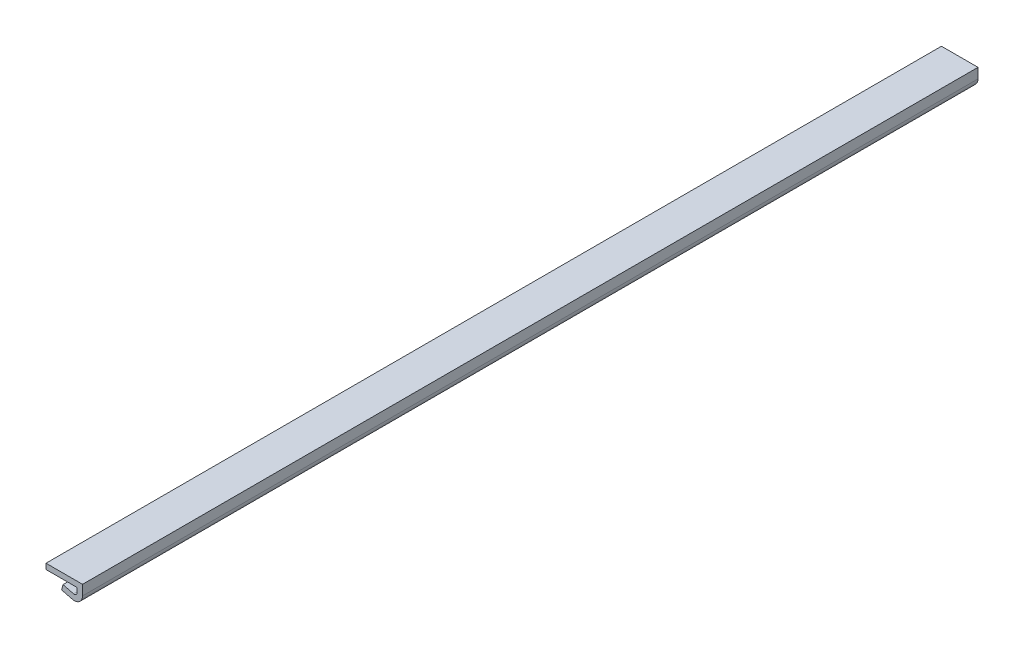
ISO-10303-21;
HEADER;
FILE_DESCRIPTION(('STEP AP214'),'2;1');
FILE_NAME('part.step','',(''),(''),'','','');
FILE_SCHEMA(('AUTOMOTIVE_DESIGN { 1 0 10303 214 1 1 1 1 }'));
ENDSEC;
DATA;
#1=APPLICATION_CONTEXT('core data for automotive mechanical design processes');
#2=APPLICATION_PROTOCOL_DEFINITION('international standard','automotive_design',2000,#1);
#3=PRODUCT_CONTEXT('',#1,'mechanical');
#4=PRODUCT('Part','Part','',(#3));
#5=PRODUCT_RELATED_PRODUCT_CATEGORY('part','',(#4));
#6=PRODUCT_DEFINITION_FORMATION('','',#4);
#7=PRODUCT_DEFINITION_CONTEXT('part definition',#1,'design');
#8=PRODUCT_DEFINITION('design','',#6,#7);
#9=PRODUCT_DEFINITION_SHAPE('','',#8);
#10=(LENGTH_UNIT() NAMED_UNIT(*) SI_UNIT(.MILLI.,.METRE.));
#11=(NAMED_UNIT(*) PLANE_ANGLE_UNIT() SI_UNIT($,.RADIAN.));
#12=(NAMED_UNIT(*) SI_UNIT($,.STERADIAN.) SOLID_ANGLE_UNIT());
#13=UNCERTAINTY_MEASURE_WITH_UNIT(LENGTH_MEASURE(1.E-05),#10,'distance_accuracy_value','');
#14=(GEOMETRIC_REPRESENTATION_CONTEXT(3) GLOBAL_UNCERTAINTY_ASSIGNED_CONTEXT((#13)) GLOBAL_UNIT_ASSIGNED_CONTEXT((#10,
#11,#12)) REPRESENTATION_CONTEXT('',''));
#15=CARTESIAN_POINT('',(0.,0.,0.));
#16=DIRECTION('',(0.,0.,1.));
#17=DIRECTION('',(1.,0.,0.));
#18=AXIS2_PLACEMENT_3D('',#15,#16,#17);
#19=CARTESIAN_POINT('',(0.,-1.66533453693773E-13,490.));
#20=DIRECTION('',(1.,0.,0.));
#21=DIRECTION('',(0.,1.,0.));
#22=AXIS2_PLACEMENT_3D('',#19,#20,#21);
#23=PLANE('',#22);
#24=DIRECTION('',(0.,-1.,0.));
#25=VECTOR('',#24,1.);
#26=CARTESIAN_POINT('',(0.,0.,0.));
#27=LINE('',#26,#25);
#28=CARTESIAN_POINT('',(0.,0.,0.));
#29=VERTEX_POINT('',#28);
#30=CARTESIAN_POINT('',(0.,-3.,0.));
#31=VERTEX_POINT('',#30);
#32=EDGE_CURVE('E119',#29,#31,#27,.T.);
#33=ORIENTED_EDGE('',*,*,#32,.T.);
#34=DIRECTION('',(0.,0.,-1.));
#35=VECTOR('',#34,1.);
#36=CARTESIAN_POINT('',(0.,-3.00000000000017,490.));
#37=LINE('',#36,#35);
#38=CARTESIAN_POINT('',(0.,-3.00000000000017,490.));
#39=VERTEX_POINT('',#38);
#40=EDGE_CURVE('E11',#39,#31,#37,.T.);
#41=ORIENTED_EDGE('',*,*,#40,.F.);
#42=DIRECTION('',(0.,-1.,0.));
#43=VECTOR('',#42,1.);
#44=CARTESIAN_POINT('',(0.,-1.66533453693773E-13,490.));
#45=LINE('',#44,#43);
#46=CARTESIAN_POINT('',(0.,-1.66533453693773E-13,490.));
#47=VERTEX_POINT('',#46);
#48=EDGE_CURVE('E161',#47,#39,#45,.T.);
#49=ORIENTED_EDGE('',*,*,#48,.F.);
#50=DIRECTION('',(0.,0.,-1.));
#51=VECTOR('',#50,1.);
#52=CARTESIAN_POINT('',(0.,-1.66533453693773E-13,490.));
#53=LINE('',#52,#51);
#54=EDGE_CURVE('E133',#47,#29,#53,.T.);
#55=ORIENTED_EDGE('',*,*,#54,.T.);
#56=EDGE_LOOP('',(#33,#41,#49,#55));
#57=FACE_BOUND('',#56,.T.);
#58=ADVANCED_FACE('F38',(#57),#23,.F.);
#59=CARTESIAN_POINT('',(0.,-3.00000000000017,490.));
#60=DIRECTION('',(0.,1.,0.));
#61=DIRECTION('',(-1.,0.,0.));
#62=AXIS2_PLACEMENT_3D('',#59,#60,#61);
#63=PLANE('',#62);
#64=DIRECTION('',(1.,0.,0.));
#65=VECTOR('',#64,1.);
#66=CARTESIAN_POINT('',(0.,-3.,0.));
#67=LINE('',#66,#65);
#68=CARTESIAN_POINT('',(17.,-3.,0.));
#69=VERTEX_POINT('',#68);
#70=EDGE_CURVE('E115',#31,#69,#67,.T.);
#71=ORIENTED_EDGE('',*,*,#70,.T.);
#72=DIRECTION('',(0.,0.,-1.));
#73=VECTOR('',#72,1.);
#74=CARTESIAN_POINT('',(17.,-3.,490.));
#75=LINE('',#74,#73);
#76=CARTESIAN_POINT('',(17.,-3.,490.));
#77=VERTEX_POINT('',#76);
#78=EDGE_CURVE('E46',#77,#69,#75,.T.);
#79=ORIENTED_EDGE('',*,*,#78,.F.);
#80=DIRECTION('',(1.,0.,0.));
#81=VECTOR('',#80,1.);
#82=CARTESIAN_POINT('',(0.,-3.00000000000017,490.));
#83=LINE('',#82,#81);
#84=EDGE_CURVE('E129',#39,#77,#83,.T.);
#85=ORIENTED_EDGE('',*,*,#84,.F.);
#86=ORIENTED_EDGE('',*,*,#40,.T.);
#87=EDGE_LOOP('',(#71,#79,#85,#86));
#88=FACE_BOUND('',#87,.T.);
#89=ADVANCED_FACE('F128',(#88),#63,.F.);
#90=CARTESIAN_POINT('',(17.,-3.,490.));
#91=DIRECTION('',(1.,0.,0.));
#92=DIRECTION('',(0.,0.,-1.));
#93=AXIS2_PLACEMENT_3D('',#90,#91,#92);
#94=PLANE('',#93);
#95=DIRECTION('',(0.,-1.,0.));
#96=VECTOR('',#95,1.);
#97=CARTESIAN_POINT('',(17.,-3.,0.));
#98=LINE('',#97,#96);
#99=CARTESIAN_POINT('',(17.,-5.49999999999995,0.));
#100=VERTEX_POINT('',#99);
#101=EDGE_CURVE('E121',#69,#100,#98,.T.);
#102=ORIENTED_EDGE('',*,*,#101,.T.);
#103=DIRECTION('',(0.,0.,-1.));
#104=VECTOR('',#103,1.);
#105=CARTESIAN_POINT('',(17.,-5.50000000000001,489.999999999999));
#106=LINE('',#105,#104);
#107=CARTESIAN_POINT('',(17.,-5.50000000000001,489.999999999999));
#108=VERTEX_POINT('',#107);
#109=EDGE_CURVE('E213',#108,#100,#106,.T.);
#110=ORIENTED_EDGE('',*,*,#109,.F.);
#111=DIRECTION('',(0.,-1.,0.));
#112=VECTOR('',#111,1.);
#113=CARTESIAN_POINT('',(17.,-3.,490.));
#114=LINE('',#113,#112);
#115=EDGE_CURVE('E166',#77,#108,#114,.T.);
#116=ORIENTED_EDGE('',*,*,#115,.F.);
#117=ORIENTED_EDGE('',*,*,#78,.T.);
#118=EDGE_LOOP('',(#102,#110,#116,#117));
#119=FACE_BOUND('',#118,.T.);
#120=ADVANCED_FACE('F219',(#119),#94,.F.);
#121=CARTESIAN_POINT('',(15.5000000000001,-5.50000000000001,489.999999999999));
#122=DIRECTION('',(0.,0.,-1.));
#123=DIRECTION('',(-1.,0.,0.));
#124=AXIS2_PLACEMENT_3D('',#121,#122,#123);
#125=CYLINDRICAL_SURFACE('',#124,1.5);
#126=CARTESIAN_POINT('',(15.5,-5.50000000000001,0.));
#127=DIRECTION('',(0.,0.,-1.));
#128=DIRECTION('',(1.,0.,0.));
#129=AXIS2_PLACEMENT_3D('',#126,#127,#128);
#130=CIRCLE('',#129,1.5);
#131=CARTESIAN_POINT('',(15.1371171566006,-6.95544358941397,0.));
#132=VERTEX_POINT('',#131);
#133=EDGE_CURVE('E141',#100,#132,#130,.T.);
#134=ORIENTED_EDGE('',*,*,#133,.T.);
#135=DIRECTION('',(0.,0.,-1.));
#136=VECTOR('',#135,1.);
#137=CARTESIAN_POINT('',(15.1371171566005,-6.95544358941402,489.999999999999));
#138=LINE('',#137,#136);
#139=CARTESIAN_POINT('',(15.1371171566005,-6.95544358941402,489.999999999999));
#140=VERTEX_POINT('',#139);
#141=EDGE_CURVE('E209',#140,#132,#138,.T.);
#142=ORIENTED_EDGE('',*,*,#141,.F.);
#143=CARTESIAN_POINT('',(15.5000000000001,-5.50000000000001,489.999999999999));
#144=DIRECTION('',(0.,0.,-1.));
#145=DIRECTION('',(1.,0.,0.));
#146=AXIS2_PLACEMENT_3D('',#143,#144,#145);
#147=CIRCLE('',#146,1.5);
#148=EDGE_CURVE('E169',#108,#140,#147,.T.);
#149=ORIENTED_EDGE('',*,*,#148,.F.);
#150=ORIENTED_EDGE('',*,*,#109,.T.);
#151=EDGE_LOOP('',(#134,#142,#149,#150));
#152=FACE_BOUND('',#151,.T.);
#153=ADVANCED_FACE('F227',(#152),#125,.F.);
#154=CARTESIAN_POINT('',(9.2996517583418,-5.50000000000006,489.999999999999));
#155=DIRECTION('',(-0.241921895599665,-0.970295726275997,0.));
#156=DIRECTION('',(0.970295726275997,-0.241921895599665,0.));
#157=AXIS2_PLACEMENT_3D('',#154,#155,#156);
#158=PLANE('',#157);
#159=DIRECTION('',(-0.970295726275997,0.241921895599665,0.));
#160=VECTOR('',#159,1.);
#161=CARTESIAN_POINT('',(9.2996517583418,-5.49999999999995,0.));
#162=LINE('',#161,#160);
#163=CARTESIAN_POINT('',(9.2996517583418,-5.49999999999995,0.));
#164=VERTEX_POINT('',#163);
#165=EDGE_CURVE('E144',#132,#164,#162,.T.);
#166=ORIENTED_EDGE('',*,*,#165,.T.);
#167=DIRECTION('',(0.,0.,-1.));
#168=VECTOR('',#167,1.);
#169=CARTESIAN_POINT('',(9.2996517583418,-5.50000000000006,489.999999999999));
#170=LINE('',#169,#168);
#171=CARTESIAN_POINT('',(9.2996517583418,-5.50000000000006,489.999999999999));
#172=VERTEX_POINT('',#171);
#173=EDGE_CURVE('E205',#172,#164,#170,.T.);
#174=ORIENTED_EDGE('',*,*,#173,.F.);
#175=DIRECTION('',(-0.970295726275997,0.241921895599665,0.));
#176=VECTOR('',#175,1.);
#177=CARTESIAN_POINT('',(9.2996517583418,-5.50000000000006,489.999999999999));
#178=LINE('',#177,#176);
#179=EDGE_CURVE('E172',#140,#172,#178,.T.);
#180=ORIENTED_EDGE('',*,*,#179,.F.);
#181=ORIENTED_EDGE('',*,*,#141,.T.);
#182=EDGE_LOOP('',(#166,#174,#180,#181));
#183=FACE_BOUND('',#182,.T.);
#184=ADVANCED_FACE('F230',(#183),#158,.F.);
#185=CARTESIAN_POINT('',(8.57388607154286,-8.41088717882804,490.));
#186=DIRECTION('',(0.970295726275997,-0.241921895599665,0.));
#187=DIRECTION('',(0.241921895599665,0.970295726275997,0.));
#188=AXIS2_PLACEMENT_3D('',#185,#186,#187);
#189=PLANE('',#188);
#190=DIRECTION('',(-0.241921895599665,-0.970295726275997,0.));
#191=VECTOR('',#190,1.);
#192=CARTESIAN_POINT('',(8.57388607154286,-8.41088717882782,0.));
#193=LINE('',#192,#191);
#194=CARTESIAN_POINT('',(8.57388607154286,-8.41088717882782,0.));
#195=VERTEX_POINT('',#194);
#196=EDGE_CURVE('E147',#164,#195,#193,.T.);
#197=ORIENTED_EDGE('',*,*,#196,.T.);
#198=DIRECTION('',(0.,0.,-1.));
#199=VECTOR('',#198,1.);
#200=CARTESIAN_POINT('',(8.57388607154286,-8.41088717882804,490.));
#201=LINE('',#200,#199);
#202=CARTESIAN_POINT('',(8.57388607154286,-8.41088717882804,490.));
#203=VERTEX_POINT('',#202);
#204=EDGE_CURVE('E201',#203,#195,#201,.T.);
#205=ORIENTED_EDGE('',*,*,#204,.F.);
#206=DIRECTION('',(-0.241921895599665,-0.970295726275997,0.));
#207=VECTOR('',#206,1.);
#208=CARTESIAN_POINT('',(8.57388607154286,-8.41088717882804,490.));
#209=LINE('',#208,#207);
#210=EDGE_CURVE('E175',#172,#203,#209,.T.);
#211=ORIENTED_EDGE('',*,*,#210,.F.);
#212=ORIENTED_EDGE('',*,*,#173,.T.);
#213=EDGE_LOOP('',(#197,#205,#211,#212));
#214=FACE_BOUND('',#213,.T.);
#215=ADVANCED_FACE('F235',(#214),#189,.F.);
#216=CARTESIAN_POINT('',(14.4113514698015,-9.86633076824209,490.));
#217=DIRECTION('',(0.241921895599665,0.970295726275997,0.));
#218=DIRECTION('',(-0.970295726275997,0.241921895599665,0.));
#219=AXIS2_PLACEMENT_3D('',#216,#217,#218);
#220=PLANE('',#219);
#221=DIRECTION('',(0.970295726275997,-0.241921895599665,0.));
#222=VECTOR('',#221,1.);
#223=CARTESIAN_POINT('',(14.4113514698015,-9.866330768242,0.));
#224=LINE('',#223,#222);
#225=CARTESIAN_POINT('',(14.4113514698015,-9.866330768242,0.));
#226=VERTEX_POINT('',#225);
#227=EDGE_CURVE('E150',#195,#226,#224,.T.);
#228=ORIENTED_EDGE('',*,*,#227,.T.);
#229=DIRECTION('',(0.,0.,-1.));
#230=VECTOR('',#229,1.);
#231=CARTESIAN_POINT('',(14.4113514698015,-9.86633076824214,490.));
#232=LINE('',#231,#230);
#233=CARTESIAN_POINT('',(14.4113514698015,-9.86633076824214,490.));
#234=VERTEX_POINT('',#233);
#235=EDGE_CURVE('E197',#234,#226,#232,.T.);
#236=ORIENTED_EDGE('',*,*,#235,.F.);
#237=DIRECTION('',(0.970295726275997,-0.241921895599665,0.));
#238=VECTOR('',#237,1.);
#239=CARTESIAN_POINT('',(14.4113514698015,-9.86633076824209,490.));
#240=LINE('',#239,#238);
#241=EDGE_CURVE('E177',#203,#234,#240,.T.);
#242=ORIENTED_EDGE('',*,*,#241,.F.);
#243=ORIENTED_EDGE('',*,*,#204,.T.);
#244=EDGE_LOOP('',(#228,#236,#242,#243));
#245=FACE_BOUND('',#244,.T.);
#246=ADVANCED_FACE('F241',(#245),#220,.F.);
#247=CARTESIAN_POINT('',(15.5000000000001,-5.50000000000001,489.999999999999));
#248=DIRECTION('',(0.,0.,-1.));
#249=DIRECTION('',(-1.,0.,0.));
#250=AXIS2_PLACEMENT_3D('',#247,#248,#249);
#251=CYLINDRICAL_SURFACE('',#250,4.5);
#252=CARTESIAN_POINT('',(15.5,-5.50000000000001,0.));
#253=DIRECTION('',(0.,0.,1.));
#254=DIRECTION('',(-1.,0.,0.));
#255=AXIS2_PLACEMENT_3D('',#252,#253,#254);
#256=CIRCLE('',#255,4.5);
#257=CARTESIAN_POINT('',(20.,-5.50000000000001,0.));
#258=VERTEX_POINT('',#257);
#259=EDGE_CURVE('E153',#226,#258,#256,.T.);
#260=ORIENTED_EDGE('',*,*,#259,.T.);
#261=DIRECTION('',(0.,0.,-1.));
#262=VECTOR('',#261,1.);
#263=CARTESIAN_POINT('',(20.,-5.50000000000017,489.999999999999));
#264=LINE('',#263,#262);
#265=CARTESIAN_POINT('',(20.,-5.50000000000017,489.999999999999));
#266=VERTEX_POINT('',#265);
#267=EDGE_CURVE('E193',#266,#258,#264,.T.);
#268=ORIENTED_EDGE('',*,*,#267,.F.);
#269=CARTESIAN_POINT('',(15.5000000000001,-5.50000000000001,489.999999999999));
#270=DIRECTION('',(0.,0.,1.));
#271=DIRECTION('',(-1.,0.,0.));
#272=AXIS2_PLACEMENT_3D('',#269,#270,#271);
#273=CIRCLE('',#272,4.5);
#274=EDGE_CURVE('E180',#234,#266,#273,.T.);
#275=ORIENTED_EDGE('',*,*,#274,.F.);
#276=ORIENTED_EDGE('',*,*,#235,.T.);
#277=EDGE_LOOP('',(#260,#268,#275,#276));
#278=FACE_BOUND('',#277,.T.);
#279=ADVANCED_FACE('F245',(#278),#251,.T.);
#280=CARTESIAN_POINT('',(20.,-1.66533453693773E-13,490.));
#281=DIRECTION('',(-1.,0.,0.));
#282=DIRECTION('',(0.,0.,1.));
#283=AXIS2_PLACEMENT_3D('',#280,#281,#282);
#284=PLANE('',#283);
#285=DIRECTION('',(0.,1.,0.));
#286=VECTOR('',#285,1.);
#287=CARTESIAN_POINT('',(20.,0.,0.));
#288=LINE('',#287,#286);
#289=CARTESIAN_POINT('',(20.,0.,0.));
#290=VERTEX_POINT('',#289);
#291=EDGE_CURVE('E156',#258,#290,#288,.T.);
#292=ORIENTED_EDGE('',*,*,#291,.T.);
#293=DIRECTION('',(0.,0.,-1.));
#294=VECTOR('',#293,1.);
#295=CARTESIAN_POINT('',(20.,-1.66533453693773E-13,490.));
#296=LINE('',#295,#294);
#297=CARTESIAN_POINT('',(20.,-1.66533453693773E-13,490.));
#298=VERTEX_POINT('',#297);
#299=EDGE_CURVE('E189',#298,#290,#296,.T.);
#300=ORIENTED_EDGE('',*,*,#299,.F.);
#301=DIRECTION('',(0.,1.,0.));
#302=VECTOR('',#301,1.);
#303=CARTESIAN_POINT('',(20.,-1.66533453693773E-13,490.));
#304=LINE('',#303,#302);
#305=EDGE_CURVE('E58',#266,#298,#304,.T.);
#306=ORIENTED_EDGE('',*,*,#305,.F.);
#307=ORIENTED_EDGE('',*,*,#267,.T.);
#308=EDGE_LOOP('',(#292,#300,#306,#307));
#309=FACE_BOUND('',#308,.T.);
#310=ADVANCED_FACE('F248',(#309),#284,.F.);
#311=CARTESIAN_POINT('',(0.,-1.66533453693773E-13,490.));
#312=DIRECTION('',(0.,-1.,0.));
#313=DIRECTION('',(0.,0.,-1.));
#314=AXIS2_PLACEMENT_3D('',#311,#312,#313);
#315=PLANE('',#314);
#316=DIRECTION('',(-1.,0.,0.));
#317=VECTOR('',#316,1.);
#318=CARTESIAN_POINT('',(0.,0.,0.));
#319=LINE('',#318,#317);
#320=EDGE_CURVE('E159',#290,#29,#319,.T.);
#321=ORIENTED_EDGE('',*,*,#320,.T.);
#322=ORIENTED_EDGE('',*,*,#54,.F.);
#323=DIRECTION('',(-1.,0.,0.));
#324=VECTOR('',#323,1.);
#325=CARTESIAN_POINT('',(0.,-1.66533453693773E-13,490.));
#326=LINE('',#325,#324);
#327=EDGE_CURVE('E53',#298,#47,#326,.T.);
#328=ORIENTED_EDGE('',*,*,#327,.F.);
#329=ORIENTED_EDGE('',*,*,#299,.T.);
#330=EDGE_LOOP('',(#321,#322,#328,#329));
#331=FACE_BOUND('',#330,.T.);
#332=ADVANCED_FACE('F250',(#331),#315,.F.);
#333=CARTESIAN_POINT('',(15.5000000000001,-5.50000000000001,489.999999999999));
#334=DIRECTION('',(0.,0.,1.));
#335=DIRECTION('',(1.,0.,0.));
#336=AXIS2_PLACEMENT_3D('',#333,#334,#335);
#337=PLANE('',#336);
#338=ORIENTED_EDGE('',*,*,#48,.T.);
#339=ORIENTED_EDGE('',*,*,#84,.T.);
#340=ORIENTED_EDGE('',*,*,#115,.T.);
#341=ORIENTED_EDGE('',*,*,#148,.T.);
#342=ORIENTED_EDGE('',*,*,#179,.T.);
#343=ORIENTED_EDGE('',*,*,#210,.T.);
#344=ORIENTED_EDGE('',*,*,#241,.T.);
#345=ORIENTED_EDGE('',*,*,#274,.T.);
#346=ORIENTED_EDGE('',*,*,#305,.T.);
#347=ORIENTED_EDGE('',*,*,#327,.T.);
#348=EDGE_LOOP('',(#338,#339,#340,#341,#342,#343,#344,#345,#346,#347));
#349=FACE_BOUND('',#348,.T.);
#350=ADVANCED_FACE('F222',(#349),#337,.T.);
#351=CARTESIAN_POINT('',(15.5,-5.50000000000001,0.));
#352=DIRECTION('',(0.,0.,1.));
#353=DIRECTION('',(1.,0.,0.));
#354=AXIS2_PLACEMENT_3D('',#351,#352,#353);
#355=PLANE('',#354);
#356=ORIENTED_EDGE('',*,*,#32,.F.);
#357=ORIENTED_EDGE('',*,*,#320,.F.);
#358=ORIENTED_EDGE('',*,*,#291,.F.);
#359=ORIENTED_EDGE('',*,*,#259,.F.);
#360=ORIENTED_EDGE('',*,*,#227,.F.);
#361=ORIENTED_EDGE('',*,*,#196,.F.);
#362=ORIENTED_EDGE('',*,*,#165,.F.);
#363=ORIENTED_EDGE('',*,*,#133,.F.);
#364=ORIENTED_EDGE('',*,*,#101,.F.);
#365=ORIENTED_EDGE('',*,*,#70,.F.);
#366=EDGE_LOOP('',(#356,#357,#358,#359,#360,#361,#362,#363,#364,#365));
#367=FACE_BOUND('',#366,.T.);
#368=ADVANCED_FACE('F116',(#367),#355,.F.);
#369=CLOSED_SHELL('',(#58,#89,#120,#153,#184,#215,#246,#279,#310,#332,#350,#368));
#370=MANIFOLD_SOLID_BREP('B2',#369);
#371=ADVANCED_BREP_SHAPE_REPRESENTATION('',(#18,#370),#14);
#372=SHAPE_DEFINITION_REPRESENTATION(#9,#371);
ENDSEC;
END-ISO-10303-21;
